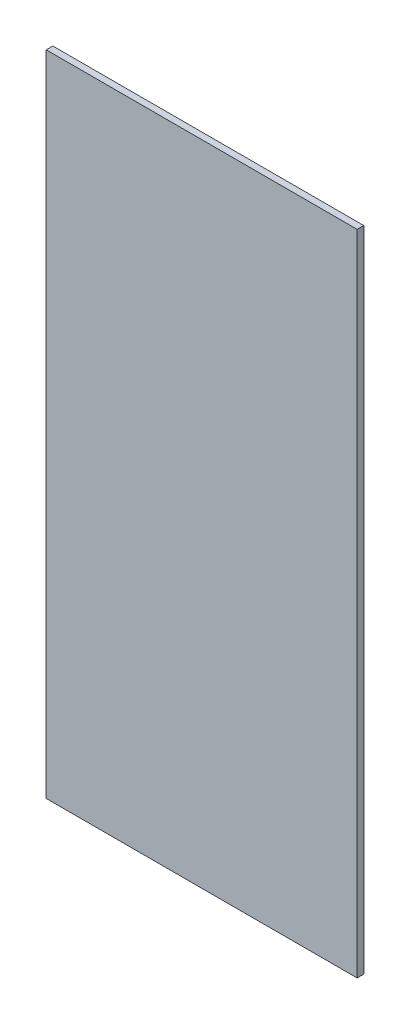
ISO-10303-21;
HEADER;
FILE_DESCRIPTION(('STEP AP214'),'2;1');
FILE_NAME('part.step','',(''),(''),'','','');
FILE_SCHEMA(('AUTOMOTIVE_DESIGN { 1 0 10303 214 1 1 1 1 }'));
ENDSEC;
DATA;
#1=APPLICATION_CONTEXT('core data for automotive mechanical design processes');
#2=APPLICATION_PROTOCOL_DEFINITION('international standard','automotive_design',2000,#1);
#3=PRODUCT_CONTEXT('',#1,'mechanical');
#4=PRODUCT('Part','Part','',(#3));
#5=PRODUCT_RELATED_PRODUCT_CATEGORY('part','',(#4));
#6=PRODUCT_DEFINITION_FORMATION('','',#4);
#7=PRODUCT_DEFINITION_CONTEXT('part definition',#1,'design');
#8=PRODUCT_DEFINITION('design','',#6,#7);
#9=PRODUCT_DEFINITION_SHAPE('','',#8);
#10=(LENGTH_UNIT() NAMED_UNIT(*) SI_UNIT(.MILLI.,.METRE.));
#11=(NAMED_UNIT(*) PLANE_ANGLE_UNIT() SI_UNIT($,.RADIAN.));
#12=(NAMED_UNIT(*) SI_UNIT($,.STERADIAN.) SOLID_ANGLE_UNIT());
#13=UNCERTAINTY_MEASURE_WITH_UNIT(LENGTH_MEASURE(1.E-05),#10,'distance_accuracy_value','');
#14=(GEOMETRIC_REPRESENTATION_CONTEXT(3) GLOBAL_UNCERTAINTY_ASSIGNED_CONTEXT((#13)) GLOBAL_UNIT_ASSIGNED_CONTEXT((#10,
#11,#12)) REPRESENTATION_CONTEXT('',''));
#15=CARTESIAN_POINT('',(0.,0.,0.));
#16=DIRECTION('',(0.,0.,1.));
#17=DIRECTION('',(1.,0.,0.));
#18=AXIS2_PLACEMENT_3D('',#15,#16,#17);
#19=CARTESIAN_POINT('',(-21.6431095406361,40.1696113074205,1.));
#20=DIRECTION('',(1.,0.,0.));
#21=DIRECTION('',(0.,0.,-1.));
#22=AXIS2_PLACEMENT_3D('',#19,#20,#21);
#23=PLANE('',#22);
#24=DIRECTION('',(0.,-1.,0.));
#25=VECTOR('',#24,1.);
#26=CARTESIAN_POINT('',(-21.6431095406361,40.1696113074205,0.));
#27=LINE('',#26,#25);
#28=CARTESIAN_POINT('',(-21.6431095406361,40.1696113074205,0.));
#29=VERTEX_POINT('',#28);
#30=CARTESIAN_POINT('',(-21.6431095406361,-57.8303886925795,0.));
#31=VERTEX_POINT('',#30);
#32=EDGE_CURVE('E96',#29,#31,#27,.T.);
#33=ORIENTED_EDGE('',*,*,#32,.T.);
#34=DIRECTION('',(0.,0.,-1.));
#35=VECTOR('',#34,1.);
#36=CARTESIAN_POINT('',(-21.6431095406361,-57.8303886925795,1.));
#37=LINE('',#36,#35);
#38=CARTESIAN_POINT('',(-21.6431095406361,-57.8303886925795,1.));
#39=VERTEX_POINT('',#38);
#40=EDGE_CURVE('E11',#39,#31,#37,.T.);
#41=ORIENTED_EDGE('',*,*,#40,.F.);
#42=DIRECTION('',(0.,-1.,0.));
#43=VECTOR('',#42,1.);
#44=CARTESIAN_POINT('',(-21.6431095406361,40.1696113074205,1.));
#45=LINE('',#44,#43);
#46=CARTESIAN_POINT('',(-21.6431095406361,40.1696113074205,1.));
#47=VERTEX_POINT('',#46);
#48=EDGE_CURVE('E84',#47,#39,#45,.T.);
#49=ORIENTED_EDGE('',*,*,#48,.F.);
#50=DIRECTION('',(0.,0.,-1.));
#51=VECTOR('',#50,1.);
#52=CARTESIAN_POINT('',(-21.6431095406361,40.1696113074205,1.));
#53=LINE('',#52,#51);
#54=EDGE_CURVE('E92',#47,#29,#53,.T.);
#55=ORIENTED_EDGE('',*,*,#54,.T.);
#56=EDGE_LOOP('',(#33,#41,#49,#55));
#57=FACE_BOUND('',#56,.T.);
#58=ADVANCED_FACE('F33',(#57),#23,.F.);
#59=CARTESIAN_POINT('',(-21.6431095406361,-57.8303886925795,1.));
#60=DIRECTION('',(0.,1.,0.));
#61=DIRECTION('',(-1.,0.,0.));
#62=AXIS2_PLACEMENT_3D('',#59,#60,#61);
#63=PLANE('',#62);
#64=DIRECTION('',(1.,0.,0.));
#65=VECTOR('',#64,1.);
#66=CARTESIAN_POINT('',(-21.6431095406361,-57.8303886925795,0.));
#67=LINE('',#66,#65);
#68=CARTESIAN_POINT('',(25.356890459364,-57.8303886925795,0.));
#69=VERTEX_POINT('',#68);
#70=EDGE_CURVE('E88',#31,#69,#67,.T.);
#71=ORIENTED_EDGE('',*,*,#70,.T.);
#72=DIRECTION('',(0.,0.,-1.));
#73=VECTOR('',#72,1.);
#74=CARTESIAN_POINT('',(25.356890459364,-57.8303886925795,1.));
#75=LINE('',#74,#73);
#76=CARTESIAN_POINT('',(25.356890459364,-57.8303886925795,1.));
#77=VERTEX_POINT('',#76);
#78=EDGE_CURVE('E41',#77,#69,#75,.T.);
#79=ORIENTED_EDGE('',*,*,#78,.F.);
#80=DIRECTION('',(1.,0.,0.));
#81=VECTOR('',#80,1.);
#82=CARTESIAN_POINT('',(-21.6431095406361,-57.8303886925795,1.));
#83=LINE('',#82,#81);
#84=EDGE_CURVE('E79',#39,#77,#83,.T.);
#85=ORIENTED_EDGE('',*,*,#84,.F.);
#86=ORIENTED_EDGE('',*,*,#40,.T.);
#87=EDGE_LOOP('',(#71,#79,#85,#86));
#88=FACE_BOUND('',#87,.T.);
#89=ADVANCED_FACE('F87',(#88),#63,.F.);
#90=CARTESIAN_POINT('',(25.3568904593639,40.1696113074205,1.));
#91=DIRECTION('',(-1.,0.,0.));
#92=DIRECTION('',(0.,-1.,0.));
#93=AXIS2_PLACEMENT_3D('',#90,#91,#92);
#94=PLANE('',#93);
#95=DIRECTION('',(0.,1.,0.));
#96=VECTOR('',#95,1.);
#97=CARTESIAN_POINT('',(25.3568904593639,40.1696113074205,0.));
#98=LINE('',#97,#96);
#99=CARTESIAN_POINT('',(25.3568904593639,40.1696113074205,0.));
#100=VERTEX_POINT('',#99);
#101=EDGE_CURVE('E66',#69,#100,#98,.T.);
#102=ORIENTED_EDGE('',*,*,#101,.T.);
#103=DIRECTION('',(0.,0.,-1.));
#104=VECTOR('',#103,1.);
#105=CARTESIAN_POINT('',(25.3568904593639,40.1696113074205,1.));
#106=LINE('',#105,#104);
#107=CARTESIAN_POINT('',(25.3568904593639,40.1696113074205,1.));
#108=VERTEX_POINT('',#107);
#109=EDGE_CURVE('E89',#108,#100,#106,.T.);
#110=ORIENTED_EDGE('',*,*,#109,.F.);
#111=DIRECTION('',(0.,1.,0.));
#112=VECTOR('',#111,1.);
#113=CARTESIAN_POINT('',(25.3568904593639,40.1696113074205,1.));
#114=LINE('',#113,#112);
#115=EDGE_CURVE('E82',#77,#108,#114,.T.);
#116=ORIENTED_EDGE('',*,*,#115,.F.);
#117=ORIENTED_EDGE('',*,*,#78,.T.);
#118=EDGE_LOOP('',(#102,#110,#116,#117));
#119=FACE_BOUND('',#118,.T.);
#120=ADVANCED_FACE('F90',(#119),#94,.F.);
#121=CARTESIAN_POINT('',(-21.6431095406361,40.1696113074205,1.));
#122=DIRECTION('',(0.,-1.,0.));
#123=DIRECTION('',(0.,0.,-1.));
#124=AXIS2_PLACEMENT_3D('',#121,#122,#123);
#125=PLANE('',#124);
#126=DIRECTION('',(-1.,0.,0.));
#127=VECTOR('',#126,1.);
#128=CARTESIAN_POINT('',(-21.6431095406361,40.1696113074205,0.));
#129=LINE('',#128,#127);
#130=EDGE_CURVE('E72',#100,#29,#129,.T.);
#131=ORIENTED_EDGE('',*,*,#130,.T.);
#132=ORIENTED_EDGE('',*,*,#54,.F.);
#133=DIRECTION('',(-1.,0.,0.));
#134=VECTOR('',#133,1.);
#135=CARTESIAN_POINT('',(-21.6431095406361,40.1696113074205,1.));
#136=LINE('',#135,#134);
#137=EDGE_CURVE('E49',#108,#47,#136,.T.);
#138=ORIENTED_EDGE('',*,*,#137,.F.);
#139=ORIENTED_EDGE('',*,*,#109,.T.);
#140=EDGE_LOOP('',(#131,#132,#138,#139));
#141=FACE_BOUND('',#140,.T.);
#142=ADVANCED_FACE('F103',(#141),#125,.F.);
#143=CARTESIAN_POINT('',(0.,0.,1.));
#144=DIRECTION('',(0.,0.,1.));
#145=DIRECTION('',(1.,0.,0.));
#146=AXIS2_PLACEMENT_3D('',#143,#144,#145);
#147=PLANE('',#146);
#148=ORIENTED_EDGE('',*,*,#48,.T.);
#149=ORIENTED_EDGE('',*,*,#84,.T.);
#150=ORIENTED_EDGE('',*,*,#115,.T.);
#151=ORIENTED_EDGE('',*,*,#137,.T.);
#152=EDGE_LOOP('',(#148,#149,#150,#151));
#153=FACE_BOUND('',#152,.T.);
#154=ADVANCED_FACE('F80',(#153),#147,.T.);
#155=CARTESIAN_POINT('',(0.,0.,0.));
#156=DIRECTION('',(0.,0.,1.));
#157=DIRECTION('',(1.,0.,0.));
#158=AXIS2_PLACEMENT_3D('',#155,#156,#157);
#159=PLANE('',#158);
#160=ORIENTED_EDGE('',*,*,#32,.F.);
#161=ORIENTED_EDGE('',*,*,#130,.F.);
#162=ORIENTED_EDGE('',*,*,#101,.F.);
#163=ORIENTED_EDGE('',*,*,#70,.F.);
#164=EDGE_LOOP('',(#160,#161,#162,#163));
#165=FACE_BOUND('',#164,.T.);
#166=ADVANCED_FACE('F106',(#165),#159,.F.);
#167=CLOSED_SHELL('',(#58,#89,#120,#142,#154,#166));
#168=MANIFOLD_SOLID_BREP('B2',#167);
#169=ADVANCED_BREP_SHAPE_REPRESENTATION('',(#18,#168),#14);
#170=SHAPE_DEFINITION_REPRESENTATION(#9,#169);
ENDSEC;
END-ISO-10303-21;
